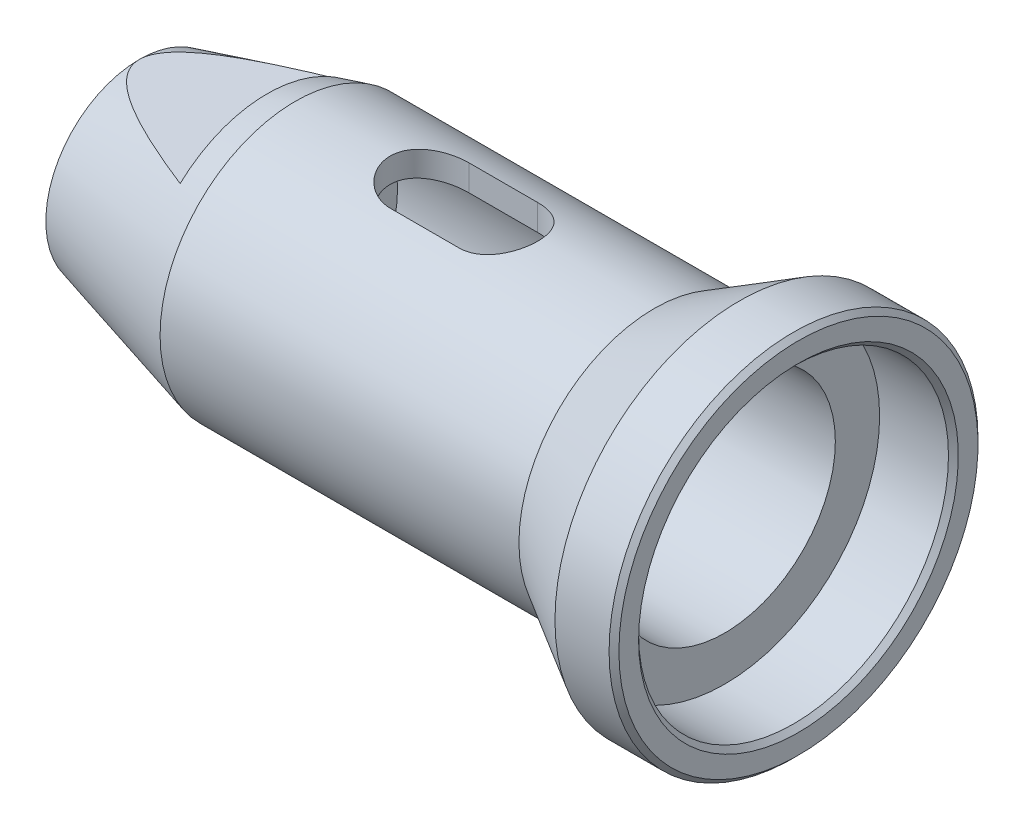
from build123d import *

# Parameters (mm, degrees)
ESQUISSE4_R                  = 11.25
ENL_V_MAT_EXTRU_2_DEPTH      = 52
ESQUISSE5_R                  = 15.75
ENL_V_MAT_EXTRU_3_DEPTH      = 7.5
ENL_V_MAT_EXTRU_5_DEPTH      = 73.05640152
ENL_V_MAT_EXTRU_5_DEPTH_BACK = 73.05640152
ESQUISSE7_W                  = 13
ESQUISSE7_H                  = 7.363774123
ESQUISSE7_H_2                = 10.171777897
ENL_V_MAT_EXTRU_6_DEPTH      = 73.05640152
ENL_V_MAT_EXTRU_6_DEPTH_BACK = 73.05640152
ESQUISSE10_R                 = 8
ENL_V_MAT_EXTRU_7_DEPTH      = 73.05640152
CHANFREIN2_SIZE              = 0.5


with BuildPart() as part:
    # Esquisse2 → R_volution1 (revolve)
    with BuildSketch(Plane.XY, mode=Mode.PRIVATE) as r_volution1_sk:
        Polygon((0, 0), (0, 9.5), (15.861215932, 13.75), (52.339745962, 13.75), (61, 18.75), (67, 18.75), (67, 0), align=None)
    revolve(r_volution1_sk.sketch.rotate(Axis((0, 0, 0), (1, 0, 0)), 90), axis=Axis((0, 0, 0), (1, 0, 0)))

    # Esquisse4 → Enl_v. mat.-Extru.2 (cut)
    with BuildSketch(Plane(origin=(67, 0, 0), x_dir=(0, 0, -1), z_dir=(1, 0, 0))):
        Circle(ESQUISSE4_R)
    extrude(amount=-ENL_V_MAT_EXTRU_2_DEPTH, mode=Mode.SUBTRACT)

    # Esquisse5 → Enl_v. mat.-Extru.3 (cut)
    with BuildSketch(Plane(origin=(67, 0, 0), x_dir=(0, 0, -1), z_dir=(1, 0, 0))):
        Circle(ESQUISSE5_R)
    extrude(amount=-ENL_V_MAT_EXTRU_3_DEPTH, mode=Mode.SUBTRACT)

    # Esquisse7 → Enl_v. mat.-Extru.5 (cut, two sides: drawn at the far end of the back side and taken through both)
    with BuildSketch(Plane.XY.offset(-ENL_V_MAT_EXTRU_5_DEPTH_BACK)):
        with Locations((6.5, 13.181887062)):
            Rectangle(ESQUISSE7_W, ESQUISSE7_H)
        with Locations((6.5, -14.585888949)):
            Rectangle(ESQUISSE7_W, ESQUISSE7_H_2)
    extrude(amount=ENL_V_MAT_EXTRU_5_DEPTH + ENL_V_MAT_EXTRU_5_DEPTH_BACK, mode=Mode.SUBTRACT)

    # Esquisse9 → Enl_v. mat.-Extru.6 (cut, two sides: drawn at the far end of the back side and taken through both)
    with BuildSketch(Plane(origin=(0, 0, 0), x_dir=(1, 0, 0), z_dir=(0, 1, 0)).offset(-ENL_V_MAT_EXTRU_6_DEPTH_BACK)):
        with BuildLine():
            Line((36.5, 4), (29.5, 4))
            ThreePointArc((29.5, 4), (25.5, 0), (29.5, -4))
            Line((29.5, -4), (36.5, -4))
            ThreePointArc((36.5, -4), (40.5, 0), (36.5, 4))
        make_face()
    extrude(amount=ENL_V_MAT_EXTRU_6_DEPTH + ENL_V_MAT_EXTRU_6_DEPTH_BACK, mode=Mode.SUBTRACT)

    # Esquisse10 → Enl_v. mat.-Extru.7 (cut, through all)
    with BuildSketch(Plane.ZY):
        with Locations(Location((0, 0, 0), (0, 0, 180))):
            Circle(ESQUISSE10_R)
    extrude(amount=-ENL_V_MAT_EXTRU_7_DEPTH, mode=Mode.SUBTRACT)

    # Chanfrein2
    chanfrein2_edges = [part.edges().sort_by_distance(p)[0] for p in [
        (67, 0, 15.75),
        (67, 0, -18.75),
        (15, 0, 8),
        (0, 0, 8),
    ]]
    chamfer(chanfrein2_edges, length=CHANFREIN2_SIZE)


solid = part.part
